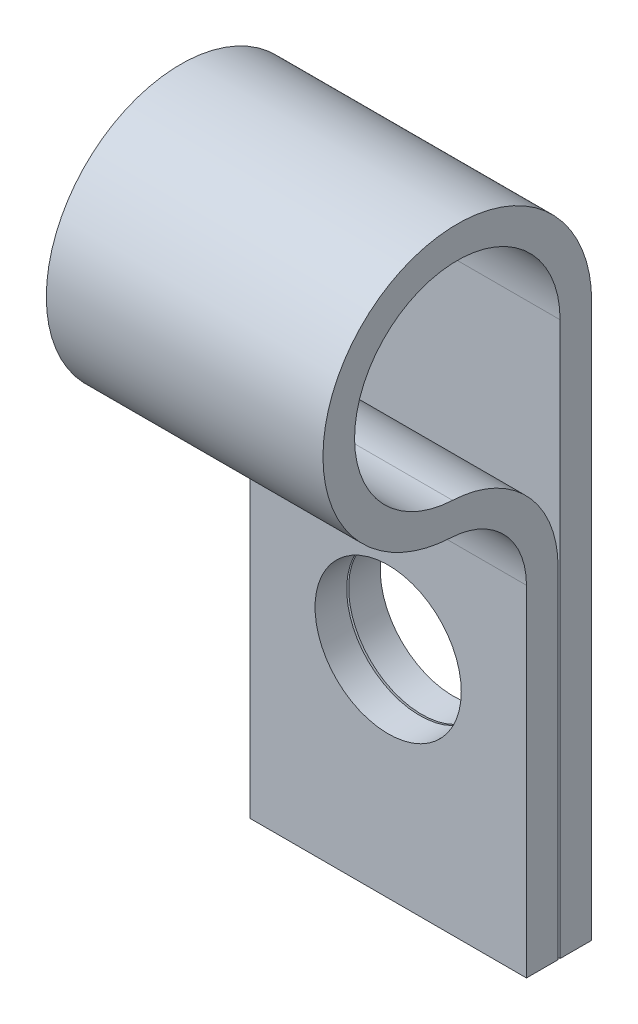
ISO-10303-21;
HEADER;
FILE_DESCRIPTION(('STEP AP214'),'2;1');
FILE_NAME('part.step','',(''),(''),'','','');
FILE_SCHEMA(('AUTOMOTIVE_DESIGN { 1 0 10303 214 1 1 1 1 }'));
ENDSEC;
DATA;
#1=APPLICATION_CONTEXT('core data for automotive mechanical design processes');
#2=APPLICATION_PROTOCOL_DEFINITION('international standard','automotive_design',2000,#1);
#3=PRODUCT_CONTEXT('',#1,'mechanical');
#4=PRODUCT('Part','Part','',(#3));
#5=PRODUCT_RELATED_PRODUCT_CATEGORY('part','',(#4));
#6=PRODUCT_DEFINITION_FORMATION('','',#4);
#7=PRODUCT_DEFINITION_CONTEXT('part definition',#1,'design');
#8=PRODUCT_DEFINITION('design','',#6,#7);
#9=PRODUCT_DEFINITION_SHAPE('','',#8);
#10=(LENGTH_UNIT() NAMED_UNIT(*) SI_UNIT(.MILLI.,.METRE.));
#11=(NAMED_UNIT(*) PLANE_ANGLE_UNIT() SI_UNIT($,.RADIAN.));
#12=(NAMED_UNIT(*) SI_UNIT($,.STERADIAN.) SOLID_ANGLE_UNIT());
#13=UNCERTAINTY_MEASURE_WITH_UNIT(LENGTH_MEASURE(1.E-05),#10,'distance_accuracy_value','');
#14=(GEOMETRIC_REPRESENTATION_CONTEXT(3) GLOBAL_UNCERTAINTY_ASSIGNED_CONTEXT((#13)) GLOBAL_UNIT_ASSIGNED_CONTEXT((#10,
#11,#12)) REPRESENTATION_CONTEXT('',''));
#15=CARTESIAN_POINT('',(0.,0.,0.));
#16=DIRECTION('',(0.,0.,1.));
#17=DIRECTION('',(1.,0.,0.));
#18=AXIS2_PLACEMENT_3D('',#15,#16,#17);
#19=CARTESIAN_POINT('',(3.5,-8.55,-3.4));
#20=DIRECTION('',(0.,0.,1.));
#21=DIRECTION('',(1.,0.,0.));
#22=AXIS2_PLACEMENT_3D('',#19,#20,#21);
#23=CYLINDRICAL_SURFACE('',#22,1.85);
#24=CARTESIAN_POINT('',(3.5,-8.55,-2.55));
#25=DIRECTION('',(0.,0.,1.));
#26=DIRECTION('',(1.,0.,0.));
#27=AXIS2_PLACEMENT_3D('',#24,#25,#26);
#28=CIRCLE('',#27,1.85);
#29=CARTESIAN_POINT('',(5.35,-8.55,-2.55));
#30=VERTEX_POINT('',#29);
#31=EDGE_CURVE('E145',#30,#30,#28,.F.);
#32=ORIENTED_EDGE('',*,*,#31,.T.);
#33=EDGE_LOOP('',(#32));
#34=FACE_BOUND('',#33,.T.);
#35=CARTESIAN_POINT('',(3.5,-8.55,-1.75));
#36=DIRECTION('',(0.,0.,1.));
#37=DIRECTION('',(1.,0.,0.));
#38=AXIS2_PLACEMENT_3D('',#35,#36,#37);
#39=CIRCLE('',#38,1.85);
#40=CARTESIAN_POINT('',(5.35,-8.55,-1.75));
#41=VERTEX_POINT('',#40);
#42=EDGE_CURVE('E18',#41,#41,#39,.T.);
#43=ORIENTED_EDGE('',*,*,#42,.T.);
#44=EDGE_LOOP('',(#43));
#45=FACE_BOUND('',#44,.T.);
#46=ADVANCED_FACE('F15',(#34,#45),#23,.F.);
#47=CARTESIAN_POINT('',(7.,-14.,-1.75));
#48=DIRECTION('',(0.,1.,0.));
#49=DIRECTION('',(0.,0.,1.));
#50=AXIS2_PLACEMENT_3D('',#47,#48,#49);
#51=PLANE('',#50);
#52=DIRECTION('',(1.,0.,0.));
#53=VECTOR('',#52,1.);
#54=CARTESIAN_POINT('',(7.,-14.,-2.55));
#55=LINE('',#54,#53);
#56=CARTESIAN_POINT('',(0.,-14.,-2.55));
#57=VERTEX_POINT('',#56);
#58=CARTESIAN_POINT('',(7.,-14.,-2.55));
#59=VERTEX_POINT('',#58);
#60=EDGE_CURVE('E148',#57,#59,#55,.T.);
#61=ORIENTED_EDGE('',*,*,#60,.T.);
#62=DIRECTION('',(0.,0.,1.));
#63=VECTOR('',#62,1.);
#64=CARTESIAN_POINT('',(7.,-14.,-1.75));
#65=LINE('',#64,#63);
#66=CARTESIAN_POINT('',(7.,-14.,-1.75));
#67=VERTEX_POINT('',#66);
#68=EDGE_CURVE('E169',#67,#59,#65,.F.);
#69=ORIENTED_EDGE('',*,*,#68,.F.);
#70=DIRECTION('',(-1.,0.,0.));
#71=VECTOR('',#70,1.);
#72=CARTESIAN_POINT('',(7.,-14.,-1.75));
#73=LINE('',#72,#71);
#74=CARTESIAN_POINT('',(0.,-14.,-1.75));
#75=VERTEX_POINT('',#74);
#76=EDGE_CURVE('E149',#67,#75,#73,.T.);
#77=ORIENTED_EDGE('',*,*,#76,.T.);
#78=DIRECTION('',(0.,0.,1.));
#79=VECTOR('',#78,1.);
#80=CARTESIAN_POINT('',(0.,-14.,-1.75));
#81=LINE('',#80,#79);
#82=EDGE_CURVE('E111',#57,#75,#81,.T.);
#83=ORIENTED_EDGE('',*,*,#82,.F.);
#84=EDGE_LOOP('',(#61,#69,#77,#83));
#85=FACE_BOUND('',#84,.T.);
#86=ADVANCED_FACE('F268',(#85),#51,.F.);
#87=CARTESIAN_POINT('',(7.,-5.39420985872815,0.25));
#88=DIRECTION('',(-1.,0.,0.));
#89=DIRECTION('',(0.,0.,1.));
#90=AXIS2_PLACEMENT_3D('',#87,#88,#89);
#91=CYLINDRICAL_SURFACE('',#90,2.);
#92=DIRECTION('',(-1.,0.,0.));
#93=VECTOR('',#92,1.);
#94=CARTESIAN_POINT('',(7.,-5.39420985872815,-1.75));
#95=LINE('',#94,#93);
#96=CARTESIAN_POINT('',(0.,-5.39420985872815,-1.75));
#97=VERTEX_POINT('',#96);
#98=CARTESIAN_POINT('',(7.,-5.39420985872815,-1.75));
#99=VERTEX_POINT('',#98);
#100=EDGE_CURVE('E101',#97,#99,#95,.F.);
#101=ORIENTED_EDGE('',*,*,#100,.T.);
#102=CARTESIAN_POINT('',(7.,-5.39420985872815,0.25));
#103=DIRECTION('',(-1.,0.,0.));
#104=DIRECTION('',(0.,0.,1.));
#105=AXIS2_PLACEMENT_3D('',#102,#103,#104);
#106=CIRCLE('',#105,2.);
#107=CARTESIAN_POINT('',(7.,-3.39635435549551,0.157407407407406));
#108=VERTEX_POINT('',#107);
#109=EDGE_CURVE('E58',#108,#99,#106,.T.);
#110=ORIENTED_EDGE('',*,*,#109,.F.);
#111=DIRECTION('',(-1.,0.,0.));
#112=VECTOR('',#111,1.);
#113=CARTESIAN_POINT('',(7.,-3.39635435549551,0.157407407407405));
#114=LINE('',#113,#112);
#115=CARTESIAN_POINT('',(0.,-3.39635435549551,0.157407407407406));
#116=VERTEX_POINT('',#115);
#117=EDGE_CURVE('E106',#116,#108,#114,.F.);
#118=ORIENTED_EDGE('',*,*,#117,.F.);
#119=CARTESIAN_POINT('',(0.,-5.39420985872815,0.25));
#120=DIRECTION('',(-1.,0.,0.));
#121=DIRECTION('',(0.,0.,1.));
#122=AXIS2_PLACEMENT_3D('',#119,#120,#121);
#123=CIRCLE('',#122,2.);
#124=EDGE_CURVE('E108',#116,#97,#123,.T.);
#125=ORIENTED_EDGE('',*,*,#124,.T.);
#126=EDGE_LOOP('',(#101,#110,#118,#125));
#127=FACE_BOUND('',#126,.T.);
#128=ADVANCED_FACE('F107',(#127),#91,.F.);
#129=CARTESIAN_POINT('',(7.,-5.39420985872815,-1.75));
#130=DIRECTION('',(0.,0.,-1.));
#131=DIRECTION('',(-1.,0.,0.));
#132=AXIS2_PLACEMENT_3D('',#129,#130,#131);
#133=PLANE('',#132);
#134=ORIENTED_EDGE('',*,*,#76,.F.);
#135=DIRECTION('',(0.,1.,0.));
#136=VECTOR('',#135,1.);
#137=CARTESIAN_POINT('',(7.,0.,-1.75));
#138=LINE('',#137,#136);
#139=EDGE_CURVE('E139',#99,#67,#138,.F.);
#140=ORIENTED_EDGE('',*,*,#139,.F.);
#141=ORIENTED_EDGE('',*,*,#100,.F.);
#142=DIRECTION('',(0.,1.,0.));
#143=VECTOR('',#142,1.);
#144=CARTESIAN_POINT('',(0.,0.,-1.75));
#145=LINE('',#144,#143);
#146=EDGE_CURVE('E115',#97,#75,#145,.F.);
#147=ORIENTED_EDGE('',*,*,#146,.T.);
#148=EDGE_LOOP('',(#134,#140,#141,#147));
#149=FACE_BOUND('',#148,.T.);
#150=ORIENTED_EDGE('',*,*,#42,.F.);
#151=EDGE_LOOP('',(#150));
#152=FACE_BOUND('',#151,.T.);
#153=ADVANCED_FACE('F269',(#149,#152),#133,.F.);
#154=CARTESIAN_POINT('',(7.,-14.,-2.55));
#155=DIRECTION('',(0.,0.,1.));
#156=DIRECTION('',(1.,0.,0.));
#157=AXIS2_PLACEMENT_3D('',#154,#155,#156);
#158=PLANE('',#157);
#159=DIRECTION('',(-1.,0.,0.));
#160=VECTOR('',#159,1.);
#161=CARTESIAN_POINT('',(7.,-5.39420985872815,-2.55));
#162=LINE('',#161,#160);
#163=CARTESIAN_POINT('',(7.,-5.39420985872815,-2.55));
#164=VERTEX_POINT('',#163);
#165=CARTESIAN_POINT('',(0.,-5.39420985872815,-2.55));
#166=VERTEX_POINT('',#165);
#167=EDGE_CURVE('E155',#164,#166,#162,.T.);
#168=ORIENTED_EDGE('',*,*,#167,.F.);
#169=DIRECTION('',(0.,1.,0.));
#170=VECTOR('',#169,1.);
#171=CARTESIAN_POINT('',(7.,0.,-2.55));
#172=LINE('',#171,#170);
#173=EDGE_CURVE('E136',#59,#164,#172,.T.);
#174=ORIENTED_EDGE('',*,*,#173,.F.);
#175=ORIENTED_EDGE('',*,*,#60,.F.);
#176=DIRECTION('',(0.,1.,0.));
#177=VECTOR('',#176,1.);
#178=CARTESIAN_POINT('',(0.,0.,-2.55));
#179=LINE('',#178,#177);
#180=EDGE_CURVE('E189',#57,#166,#179,.T.);
#181=ORIENTED_EDGE('',*,*,#180,.T.);
#182=EDGE_LOOP('',(#168,#174,#175,#181));
#183=FACE_BOUND('',#182,.T.);
#184=ORIENTED_EDGE('',*,*,#31,.F.);
#185=EDGE_LOOP('',(#184));
#186=FACE_BOUND('',#185,.T.);
#187=ADVANCED_FACE('F266',(#183,#186),#158,.F.);
#188=CARTESIAN_POINT('',(7.,-5.39420985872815,0.25));
#189=DIRECTION('',(-1.,0.,0.));
#190=DIRECTION('',(0.,0.,1.));
#191=AXIS2_PLACEMENT_3D('',#188,#189,#190);
#192=CYLINDRICAL_SURFACE('',#191,2.8);
#193=CARTESIAN_POINT('',(7.,-5.39420985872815,0.25));
#194=DIRECTION('',(-1.,0.,0.));
#195=DIRECTION('',(0.,0.,1.));
#196=AXIS2_PLACEMENT_3D('',#193,#194,#195);
#197=CIRCLE('',#196,2.8);
#198=CARTESIAN_POINT('',(7.,-2.59721215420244,0.120370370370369));
#199=VERTEX_POINT('',#198);
#200=EDGE_CURVE('E132',#164,#199,#197,.F.);
#201=ORIENTED_EDGE('',*,*,#200,.F.);
#202=ORIENTED_EDGE('',*,*,#167,.T.);
#203=CARTESIAN_POINT('',(0.,-5.39420985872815,0.25));
#204=DIRECTION('',(-1.,0.,0.));
#205=DIRECTION('',(0.,0.,1.));
#206=AXIS2_PLACEMENT_3D('',#203,#204,#205);
#207=CIRCLE('',#206,2.8);
#208=CARTESIAN_POINT('',(0.,-2.59721215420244,0.120370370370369));
#209=VERTEX_POINT('',#208);
#210=EDGE_CURVE('E186',#166,#209,#207,.F.);
#211=ORIENTED_EDGE('',*,*,#210,.T.);
#212=DIRECTION('',(-1.,0.,0.));
#213=VECTOR('',#212,1.);
#214=CARTESIAN_POINT('',(7.,-2.59721215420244,0.120370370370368));
#215=LINE('',#214,#213);
#216=EDGE_CURVE('E253',#209,#199,#215,.F.);
#217=ORIENTED_EDGE('',*,*,#216,.T.);
#218=EDGE_LOOP('',(#201,#202,#211,#217));
#219=FACE_BOUND('',#218,.T.);
#220=ADVANCED_FACE('F259',(#219),#192,.T.);
#221=CARTESIAN_POINT('',(7.,0.,0.));
#222=DIRECTION('',(-1.,0.,0.));
#223=DIRECTION('',(0.,0.,1.));
#224=AXIS2_PLACEMENT_3D('',#221,#222,#223);
#225=CYLINDRICAL_SURFACE('',#224,2.6);
#226=CARTESIAN_POINT('',(7.,0.,0.));
#227=DIRECTION('',(-1.,0.,0.));
#228=DIRECTION('',(0.,0.,1.));
#229=AXIS2_PLACEMENT_3D('',#226,#227,#228);
#230=CIRCLE('',#229,2.6);
#231=CARTESIAN_POINT('',(7.,0.,-2.6));
#232=VERTEX_POINT('',#231);
#233=EDGE_CURVE('E129',#199,#232,#230,.T.);
#234=ORIENTED_EDGE('',*,*,#233,.F.);
#235=ORIENTED_EDGE('',*,*,#216,.F.);
#236=CARTESIAN_POINT('',(0.,0.,0.));
#237=DIRECTION('',(-1.,0.,0.));
#238=DIRECTION('',(0.,0.,1.));
#239=AXIS2_PLACEMENT_3D('',#236,#237,#238);
#240=CIRCLE('',#239,2.6);
#241=CARTESIAN_POINT('',(0.,0.,-2.6));
#242=VERTEX_POINT('',#241);
#243=EDGE_CURVE('E182',#209,#242,#240,.T.);
#244=ORIENTED_EDGE('',*,*,#243,.T.);
#245=DIRECTION('',(-1.,0.,0.));
#246=VECTOR('',#245,1.);
#247=CARTESIAN_POINT('',(7.,0.,-2.6));
#248=LINE('',#247,#246);
#249=EDGE_CURVE('E144',#242,#232,#248,.F.);
#250=ORIENTED_EDGE('',*,*,#249,.T.);
#251=EDGE_LOOP('',(#234,#235,#244,#250));
#252=FACE_BOUND('',#251,.T.);
#253=ADVANCED_FACE('F264',(#252),#225,.F.);
#254=CARTESIAN_POINT('',(7.,0.,-2.6));
#255=DIRECTION('',(0.,0.,-1.));
#256=DIRECTION('',(-1.,0.,0.));
#257=AXIS2_PLACEMENT_3D('',#254,#255,#256);
#258=PLANE('',#257);
#259=DIRECTION('',(1.,0.,0.));
#260=VECTOR('',#259,1.);
#261=CARTESIAN_POINT('',(7.,-14.,-2.6));
#262=LINE('',#261,#260);
#263=CARTESIAN_POINT('',(0.,-14.,-2.6));
#264=VERTEX_POINT('',#263);
#265=CARTESIAN_POINT('',(7.,-14.,-2.6));
#266=VERTEX_POINT('',#265);
#267=EDGE_CURVE('E72',#264,#266,#262,.T.);
#268=ORIENTED_EDGE('',*,*,#267,.T.);
#269=DIRECTION('',(0.,1.,0.));
#270=VECTOR('',#269,1.);
#271=CARTESIAN_POINT('',(7.,0.,-2.6));
#272=LINE('',#271,#270);
#273=EDGE_CURVE('E125',#232,#266,#272,.F.);
#274=ORIENTED_EDGE('',*,*,#273,.F.);
#275=ORIENTED_EDGE('',*,*,#249,.F.);
#276=DIRECTION('',(0.,1.,0.));
#277=VECTOR('',#276,1.);
#278=CARTESIAN_POINT('',(0.,0.,-2.6));
#279=LINE('',#278,#277);
#280=EDGE_CURVE('E185',#242,#264,#279,.F.);
#281=ORIENTED_EDGE('',*,*,#280,.T.);
#282=EDGE_LOOP('',(#268,#274,#275,#281));
#283=FACE_BOUND('',#282,.T.);
#284=CARTESIAN_POINT('',(3.5,-8.55,-2.6));
#285=DIRECTION('',(0.,0.,1.));
#286=DIRECTION('',(1.,0.,0.));
#287=AXIS2_PLACEMENT_3D('',#284,#285,#286);
#288=CIRCLE('',#287,1.85);
#289=CARTESIAN_POINT('',(5.35,-8.55,-2.6));
#290=VERTEX_POINT('',#289);
#291=EDGE_CURVE('E141',#290,#290,#288,.F.);
#292=ORIENTED_EDGE('',*,*,#291,.T.);
#293=EDGE_LOOP('',(#292));
#294=FACE_BOUND('',#293,.T.);
#295=ADVANCED_FACE('F307',(#283,#294),#258,.F.);
#296=CARTESIAN_POINT('',(3.5,-8.55,-3.4));
#297=DIRECTION('',(0.,0.,1.));
#298=DIRECTION('',(1.,0.,0.));
#299=AXIS2_PLACEMENT_3D('',#296,#297,#298);
#300=CYLINDRICAL_SURFACE('',#299,1.85);
#301=CARTESIAN_POINT('',(3.5,-8.55,-3.4));
#302=DIRECTION('',(0.,0.,1.));
#303=DIRECTION('',(1.,0.,0.));
#304=AXIS2_PLACEMENT_3D('',#301,#302,#303);
#305=CIRCLE('',#304,1.85);
#306=CARTESIAN_POINT('',(5.35,-8.55,-3.4));
#307=VERTEX_POINT('',#306);
#308=EDGE_CURVE('E176',#307,#307,#305,.F.);
#309=ORIENTED_EDGE('',*,*,#308,.T.);
#310=EDGE_LOOP('',(#309));
#311=FACE_BOUND('',#310,.T.);
#312=ORIENTED_EDGE('',*,*,#291,.F.);
#313=EDGE_LOOP('',(#312));
#314=FACE_BOUND('',#313,.T.);
#315=ADVANCED_FACE('F303',(#311,#314),#300,.F.);
#316=CARTESIAN_POINT('',(7.,-14.,-2.6));
#317=DIRECTION('',(0.,1.,0.));
#318=DIRECTION('',(0.,0.,1.));
#319=AXIS2_PLACEMENT_3D('',#316,#317,#318);
#320=PLANE('',#319);
#321=DIRECTION('',(1.,0.,0.));
#322=VECTOR('',#321,1.);
#323=CARTESIAN_POINT('',(7.,-14.,-3.4));
#324=LINE('',#323,#322);
#325=CARTESIAN_POINT('',(0.,-14.,-3.4));
#326=VERTEX_POINT('',#325);
#327=CARTESIAN_POINT('',(7.,-14.,-3.4));
#328=VERTEX_POINT('',#327);
#329=EDGE_CURVE('E180',#326,#328,#324,.T.);
#330=ORIENTED_EDGE('',*,*,#329,.T.);
#331=DIRECTION('',(0.,0.,-1.));
#332=VECTOR('',#331,1.);
#333=CARTESIAN_POINT('',(7.,-14.,0.));
#334=LINE('',#333,#332);
#335=EDGE_CURVE('E140',#266,#328,#334,.T.);
#336=ORIENTED_EDGE('',*,*,#335,.F.);
#337=ORIENTED_EDGE('',*,*,#267,.F.);
#338=DIRECTION('',(0.,0.,-1.));
#339=VECTOR('',#338,1.);
#340=CARTESIAN_POINT('',(0.,-14.,0.));
#341=LINE('',#340,#339);
#342=EDGE_CURVE('E181',#264,#326,#341,.T.);
#343=ORIENTED_EDGE('',*,*,#342,.T.);
#344=EDGE_LOOP('',(#330,#336,#337,#343));
#345=FACE_BOUND('',#344,.T.);
#346=ADVANCED_FACE('F300',(#345),#320,.F.);
#347=CARTESIAN_POINT('',(7.,0.,0.));
#348=DIRECTION('',(1.,0.,0.));
#349=DIRECTION('',(0.,0.,-1.));
#350=AXIS2_PLACEMENT_3D('',#347,#348,#349);
#351=PLANE('',#350);
#352=ORIENTED_EDGE('',*,*,#233,.T.);
#353=ORIENTED_EDGE('',*,*,#273,.T.);
#354=ORIENTED_EDGE('',*,*,#335,.T.);
#355=DIRECTION('',(0.,1.,0.));
#356=VECTOR('',#355,1.);
#357=CARTESIAN_POINT('',(7.,-14.,-3.4));
#358=LINE('',#357,#356);
#359=CARTESIAN_POINT('',(7.,0.,-3.4));
#360=VERTEX_POINT('',#359);
#361=EDGE_CURVE('E211',#328,#360,#358,.T.);
#362=ORIENTED_EDGE('',*,*,#361,.T.);
#363=CARTESIAN_POINT('',(7.,0.,0.));
#364=DIRECTION('',(-1.,0.,0.));
#365=DIRECTION('',(0.,0.,1.));
#366=AXIS2_PLACEMENT_3D('',#363,#364,#365);
#367=CIRCLE('',#366,3.4);
#368=EDGE_CURVE('E64',#108,#360,#367,.T.);
#369=ORIENTED_EDGE('',*,*,#368,.F.);
#370=ORIENTED_EDGE('',*,*,#109,.T.);
#371=ORIENTED_EDGE('',*,*,#139,.T.);
#372=ORIENTED_EDGE('',*,*,#68,.T.);
#373=ORIENTED_EDGE('',*,*,#173,.T.);
#374=ORIENTED_EDGE('',*,*,#200,.T.);
#375=EDGE_LOOP('',(#352,#353,#354,#362,#369,#370,#371,#372,#373,#374));
#376=FACE_BOUND('',#375,.T.);
#377=ADVANCED_FACE('F265',(#376),#351,.T.);
#378=CARTESIAN_POINT('',(7.,0.,0.));
#379=DIRECTION('',(-1.,0.,0.));
#380=DIRECTION('',(0.,0.,1.));
#381=AXIS2_PLACEMENT_3D('',#378,#379,#380);
#382=CYLINDRICAL_SURFACE('',#381,3.4);
#383=DIRECTION('',(1.,0.,0.));
#384=VECTOR('',#383,1.);
#385=CARTESIAN_POINT('',(7.,0.,-3.4));
#386=LINE('',#385,#384);
#387=CARTESIAN_POINT('',(0.,0.,-3.4));
#388=VERTEX_POINT('',#387);
#389=EDGE_CURVE('E25',#360,#388,#386,.F.);
#390=ORIENTED_EDGE('',*,*,#389,.T.);
#391=CARTESIAN_POINT('',(0.,0.,0.));
#392=DIRECTION('',(-1.,0.,0.));
#393=DIRECTION('',(0.,0.,1.));
#394=AXIS2_PLACEMENT_3D('',#391,#392,#393);
#395=CIRCLE('',#394,3.4);
#396=EDGE_CURVE('E33',#388,#116,#395,.F.);
#397=ORIENTED_EDGE('',*,*,#396,.T.);
#398=ORIENTED_EDGE('',*,*,#117,.T.);
#399=ORIENTED_EDGE('',*,*,#368,.T.);
#400=EDGE_LOOP('',(#390,#397,#398,#399));
#401=FACE_BOUND('',#400,.T.);
#402=ADVANCED_FACE('F119',(#401),#382,.T.);
#403=CARTESIAN_POINT('',(0.,0.,0.));
#404=DIRECTION('',(1.,0.,0.));
#405=DIRECTION('',(0.,0.,-1.));
#406=AXIS2_PLACEMENT_3D('',#403,#404,#405);
#407=PLANE('',#406);
#408=ORIENTED_EDGE('',*,*,#280,.F.);
#409=ORIENTED_EDGE('',*,*,#243,.F.);
#410=ORIENTED_EDGE('',*,*,#210,.F.);
#411=ORIENTED_EDGE('',*,*,#180,.F.);
#412=ORIENTED_EDGE('',*,*,#82,.T.);
#413=ORIENTED_EDGE('',*,*,#146,.F.);
#414=ORIENTED_EDGE('',*,*,#124,.F.);
#415=ORIENTED_EDGE('',*,*,#396,.F.);
#416=DIRECTION('',(0.,1.,0.));
#417=VECTOR('',#416,1.);
#418=CARTESIAN_POINT('',(0.,-14.,-3.4));
#419=LINE('',#418,#417);
#420=EDGE_CURVE('E9',#388,#326,#419,.F.);
#421=ORIENTED_EDGE('',*,*,#420,.T.);
#422=ORIENTED_EDGE('',*,*,#342,.F.);
#423=EDGE_LOOP('',(#408,#409,#410,#411,#412,#413,#414,#415,#421,#422));
#424=FACE_BOUND('',#423,.T.);
#425=ADVANCED_FACE('F114',(#424),#407,.F.);
#426=CARTESIAN_POINT('',(7.,-14.,-3.4));
#427=DIRECTION('',(0.,0.,1.));
#428=DIRECTION('',(1.,0.,0.));
#429=AXIS2_PLACEMENT_3D('',#426,#427,#428);
#430=PLANE('',#429);
#431=ORIENTED_EDGE('',*,*,#389,.F.);
#432=ORIENTED_EDGE('',*,*,#361,.F.);
#433=ORIENTED_EDGE('',*,*,#329,.F.);
#434=ORIENTED_EDGE('',*,*,#420,.F.);
#435=EDGE_LOOP('',(#431,#432,#433,#434));
#436=FACE_BOUND('',#435,.T.);
#437=ORIENTED_EDGE('',*,*,#308,.F.);
#438=EDGE_LOOP('',(#437));
#439=FACE_BOUND('',#438,.T.);
#440=ADVANCED_FACE('F285',(#436,#439),#430,.F.);
#441=CLOSED_SHELL('',(#46,#86,#128,#153,#187,#220,#253,#295,#315,#346,#377,#402,#425,#440));
#442=MANIFOLD_SOLID_BREP('B1',#441);
#443=ADVANCED_BREP_SHAPE_REPRESENTATION('',(#18,#442),#14);
#444=SHAPE_DEFINITION_REPRESENTATION(#9,#443);
ENDSEC;
END-ISO-10303-21;
